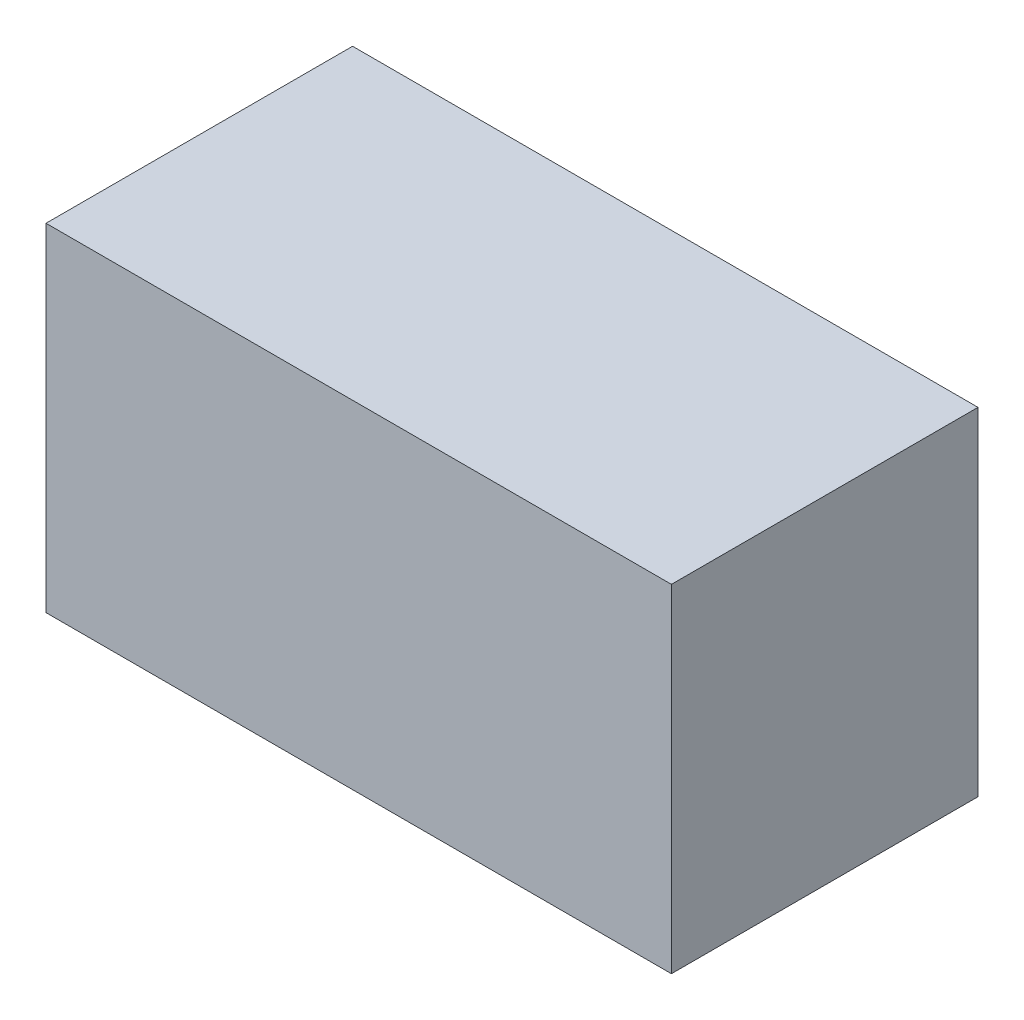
from build123d import *

# Parameters (mm, degrees)
SKETCH_1_W          = 10.2
SKETCH_1_H          = 5
EXTRUDE_1_DEPTH     = 5.5
SKETCH_7_R          = 1.5
CUT_EXTRUDE_6_DEPTH = 2
SKETCH_6_R          = 1.5
CUT_EXTRUDE_7_DEPTH = 3.2
SKETCH_3_R          = 1.5
CUT_EXTRUDE_9_DEPTH = 4.8


with BuildPart() as part:
    # Sketch 1 → Extrude 1 (new body)
    with BuildSketch(Plane(origin=(0, 0, 0), x_dir=(1, 0, 0), z_dir=(0, 1, 0))):
        with Locations((5.1, 2.5)):
            Rectangle(SKETCH_1_W, SKETCH_1_H)
    extrude(amount=EXTRUDE_1_DEPTH)

    # Sketch 7 → Cut-Extrude 6 (cut)
    with BuildSketch(Plane(origin=(0, 0, 0), x_dir=(1, 0, 0), z_dir=(0, 1, 0))):
        with Locations(Location((2, 2.5, 0), (0, 0, 270))):
            Circle(SKETCH_7_R)
    extrude(amount=CUT_EXTRUDE_6_DEPTH, mode=Mode.SUBTRACT)

    # Sketch 6 → Cut-Extrude 7 (cut)
    with BuildSketch(Plane(origin=(0, 0, 0), x_dir=(1, 0, 0), z_dir=(0, 1, 0))):
        with Locations(Location((5.1, 2.5, 0), (0, 0, 270))):
            Circle(SKETCH_6_R)
    extrude(amount=CUT_EXTRUDE_7_DEPTH, mode=Mode.SUBTRACT)

    # Sketch 3 → Cut-Extrude 9 (cut)
    with BuildSketch(Plane(origin=(0, 0, 0), x_dir=(1, 0, 0), z_dir=(0, 1, 0))):
        with Locations(Location((8.2, 2.5, 0), (0, 0, 270))):
            Circle(SKETCH_3_R)
    extrude(amount=CUT_EXTRUDE_9_DEPTH, mode=Mode.SUBTRACT)


solid = part.part
